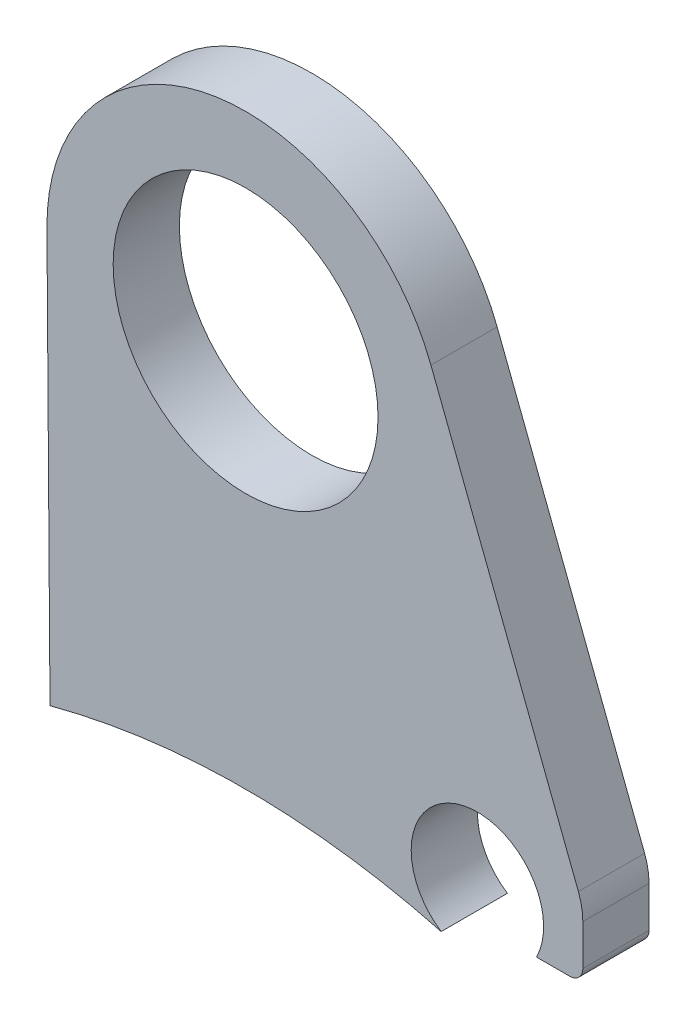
from build123d import *

# Parameters (mm, degrees)
SKETCH1_R           = 2
BOSS_EXTRUDE2_DEPTH = 1
FILLET1_R           = 1
FILLET2_R           = 0.2


with BuildPart() as part:
    # Sketch1 → Boss-Extrude2 (new body)
    with BuildSketch(Plane.XY):
        with BuildLine():
            Line((-0.382256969, 3.40616789), (-0.336125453, -2.82259432))
            ThreePointArc((-0.336125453, -2.82259432), (2.617660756, -2.436781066), (5.571446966, -2.82259432))
            ThreePointArc((5.571446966, -2.82259432), (5.859325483, -1.019453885), (7.010573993, -2.436781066))
            Line((7.010573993, -2.436781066), (7.710573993, -2.436781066))
            Line((7.710573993, -2.436781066), (7.710573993, -1.436781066))
            Line((7.710573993, -1.436781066), (5.416520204, 4.50837933))
            ThreePointArc((5.416520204, 4.50837933), (2.057461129, 6.375617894), (-0.382256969, 3.40616789))
        make_face()
        with Locations((2.617660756, 3.428385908)):
            Circle(SKETCH1_R, mode=Mode.SUBTRACT)
    extrude(amount=BOSS_EXTRUDE2_DEPTH)

    # Fillet1
    fillet1_edges = [part.edges().sort_by_distance(p)[0] for p in [
        (7.710573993, -1.436781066, 0.5),
    ]]
    fillet(fillet1_edges, radius=FILLET1_R)

    # Fillet2
    fillet2_edges = [part.edges().sort_by_distance(p)[0] for p in [
        (7.710573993, -2.436781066, 0.5),
    ]]
    fillet(fillet2_edges, radius=FILLET2_R)


solid = part.part
